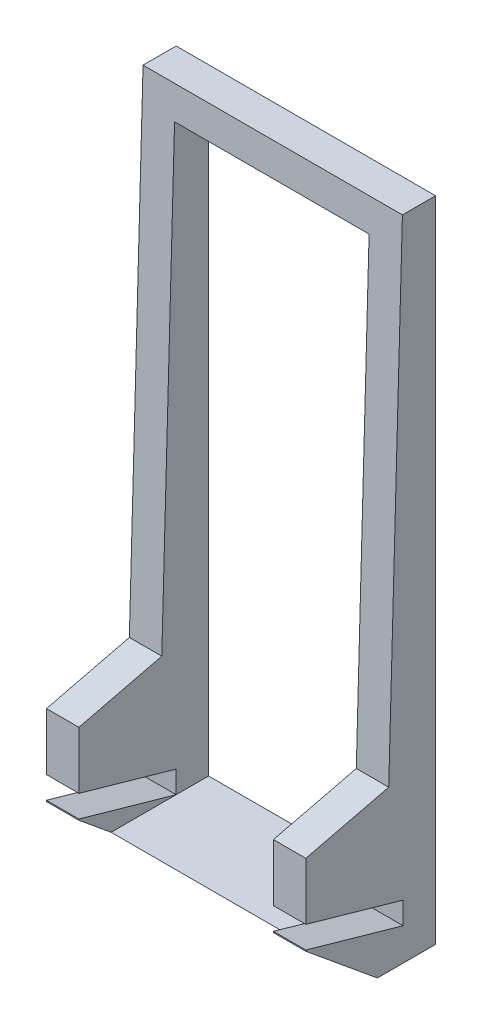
from build123d import *

# Parameters (mm, degrees)
ESQUISSE1_W             = 40
ESQUISSE1_H             = 100
ESQUISSE1_W_2           = 30
ESQUISSE1_H_2           = 90
BOSS_EXTRU_1_DEPTH      = 20
ENL_V_MAT_EXTRU_1_DEPTH = 110.544511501
ENL_V_MAT_EXTRU_2_DEPTH = 110.544511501


with BuildPart() as part:
    # Esquisse1 → Boss.-Extru.1 (new body)
    with BuildSketch(Plane.XY):
        with Locations((-17.670102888, 50)):
            Rectangle(ESQUISSE1_W, ESQUISSE1_H)
        with Locations((-17.670102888, 50)):
            Rectangle(ESQUISSE1_W_2, ESQUISSE1_H_2, mode=Mode.SUBTRACT)
    extrude(amount=BOSS_EXTRU_1_DEPTH)

    # Esquisse2 → Enl_v. mat.-Extru.1 (cut, through all)
    with BuildSketch(Plane(origin=(2.329897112, 0, 0), x_dir=(0, 0, -1), z_dir=(1, 0, 0))):
        Polygon((-20, 9.253858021), (-5, 5), (-5, 8.430133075), (-20, 12.683991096), align=None)
    extrude(amount=-ENL_V_MAT_EXTRU_1_DEPTH, mode=Mode.SUBTRACT)

    # Esquisse3 → Enl_v. mat.-Extru.2 (cut, through all)
    with BuildSketch(Plane(origin=(2.329897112, 0, 0), x_dir=(0, 0, -1), z_dir=(1, 0, 0))):
        Polygon((-20, 21.506745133), (-7.219207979, 24.61301026), (-5.106947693, 100), (-20, 100), align=None)
        Polygon((-20, 9.081684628), (-8.95871645, 0), (-20, 0), align=None)
    extrude(amount=-ENL_V_MAT_EXTRU_2_DEPTH, mode=Mode.SUBTRACT)


solid = part.part
